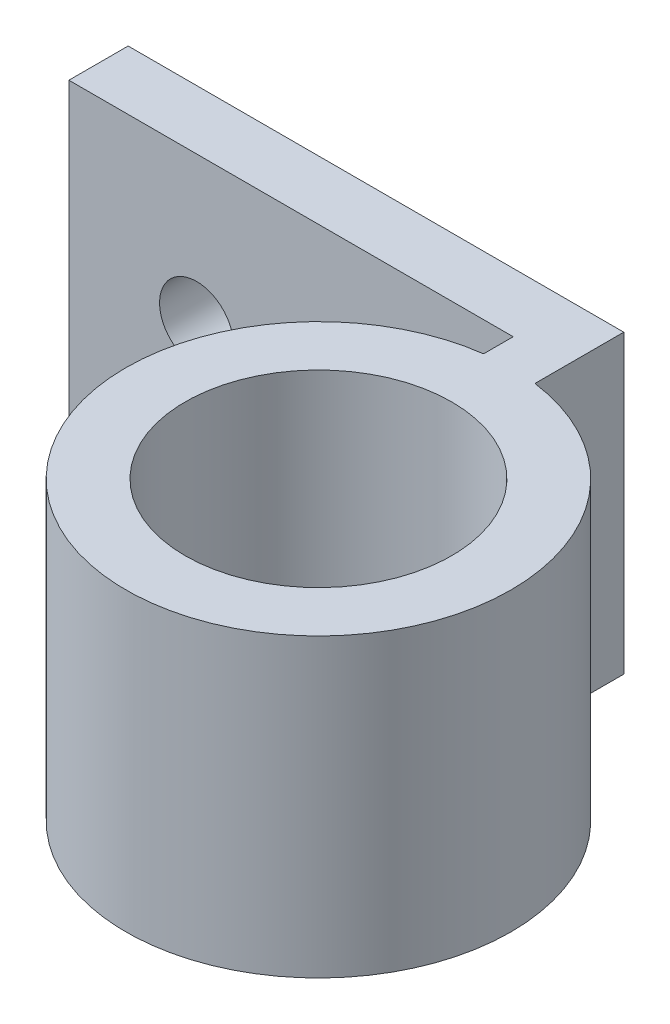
from build123d import *

# Parameters (mm, degrees)
SKETCH1_R           = 4.5
BOSS_EXTRUDE1_DEPTH = 10
SKETCH2_R           = 1.25
CUT_EXTRUDE1_DEPTH  = 10


with BuildPart() as part:
    # Sketch1 → Boss-Extrude1 (new body)
    with BuildSketch(Plane(origin=(0, 0, 0), x_dir=(1, 0, 0), z_dir=(0, 1, 0))):
        with BuildLine():
            Line((-0.866666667, 6.441963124), (-0.866666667, 7.441963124))
            Line((-0.866666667, 7.441963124), (-15.866666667, 7.441963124))
            Line((-15.866666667, 7.441963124), (-15.866666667, 9.441963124))
            Line((-15.866666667, 9.441963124), (0.866666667, 9.441963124))
            Line((0.866666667, 9.441963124), (0.866666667, 7.441963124))
            Line((0.866666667, 7.441963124), (0.866666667, 6.441963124))
            ThreePointArc((0.866666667, 6.441963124), (0, -6.5), (-0.866666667, 6.441963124))
        make_face()
        with Locations(Location((0, 0, 0), (0, 0, 270))):
            Circle(SKETCH1_R, mode=Mode.SUBTRACT)
    extrude(amount=BOSS_EXTRUDE1_DEPTH)

    # Sketch2 → Cut-Extrude1 (cut)
    with BuildSketch(Plane.XY.offset(-7.441963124)):
        with Locations((-11.555552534, 5.022755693)):
            Circle(SKETCH2_R)
    extrude(amount=-CUT_EXTRUDE1_DEPTH, mode=Mode.SUBTRACT)


solid = part.part
